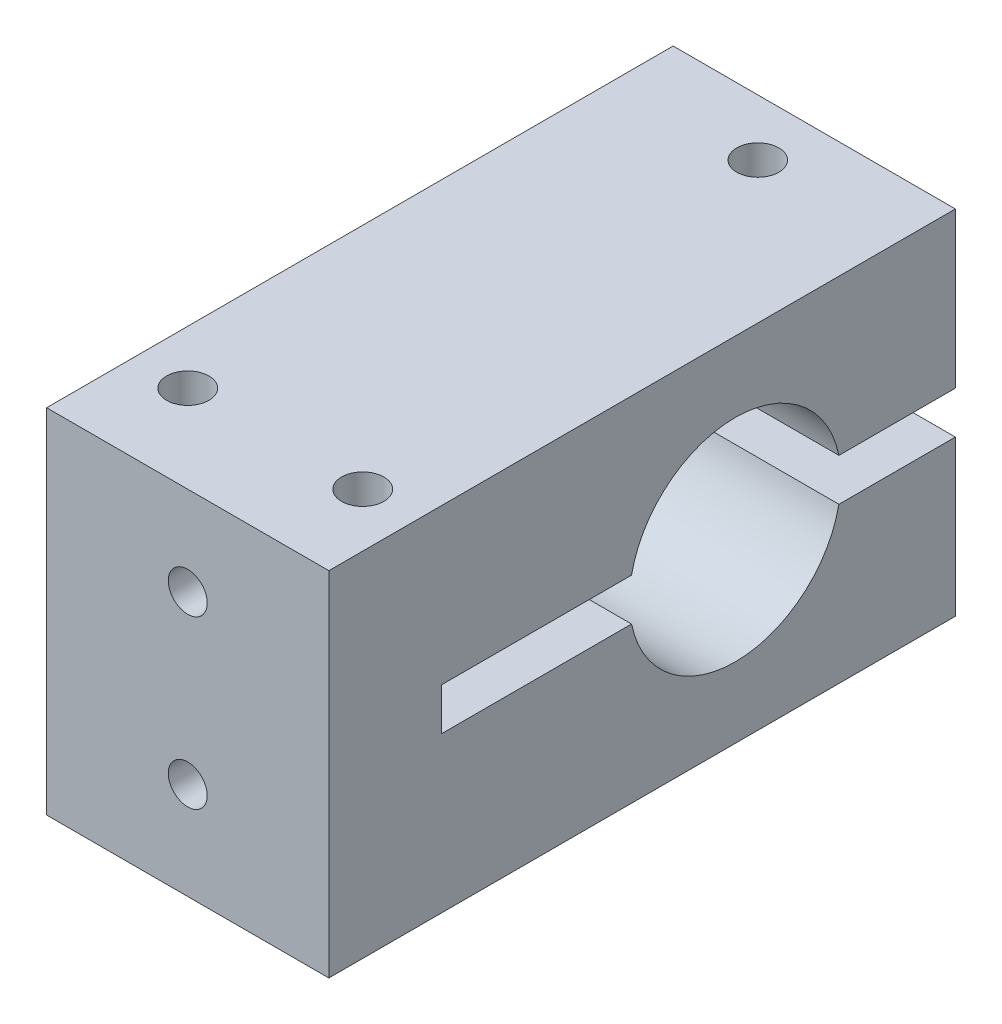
ISO-10303-21;
HEADER;
FILE_DESCRIPTION(('STEP AP214'),'2;1');
FILE_NAME('part.step','',(''),(''),'','','');
FILE_SCHEMA(('AUTOMOTIVE_DESIGN { 1 0 10303 214 1 1 1 1 }'));
ENDSEC;
DATA;
#1=APPLICATION_CONTEXT('core data for automotive mechanical design processes');
#2=APPLICATION_PROTOCOL_DEFINITION('international standard','automotive_design',2000,#1);
#3=PRODUCT_CONTEXT('',#1,'mechanical');
#4=PRODUCT('Part','Part','',(#3));
#5=PRODUCT_RELATED_PRODUCT_CATEGORY('part','',(#4));
#6=PRODUCT_DEFINITION_FORMATION('','',#4);
#7=PRODUCT_DEFINITION_CONTEXT('part definition',#1,'design');
#8=PRODUCT_DEFINITION('design','',#6,#7);
#9=PRODUCT_DEFINITION_SHAPE('','',#8);
#10=(LENGTH_UNIT() NAMED_UNIT(*) SI_UNIT(.MILLI.,.METRE.));
#11=(NAMED_UNIT(*) PLANE_ANGLE_UNIT() SI_UNIT($,.RADIAN.));
#12=(NAMED_UNIT(*) SI_UNIT($,.STERADIAN.) SOLID_ANGLE_UNIT());
#13=UNCERTAINTY_MEASURE_WITH_UNIT(LENGTH_MEASURE(1.E-05),#10,'distance_accuracy_value','');
#14=(GEOMETRIC_REPRESENTATION_CONTEXT(3) GLOBAL_UNCERTAINTY_ASSIGNED_CONTEXT((#13)) GLOBAL_UNIT_ASSIGNED_CONTEXT((#10,
#11,#12)) REPRESENTATION_CONTEXT('',''));
#15=CARTESIAN_POINT('',(0.,0.,0.));
#16=DIRECTION('',(0.,0.,1.));
#17=DIRECTION('',(1.,0.,0.));
#18=AXIS2_PLACEMENT_3D('',#15,#16,#17);
#19=CARTESIAN_POINT('',(-12.7,31.75,-28.194));
#20=DIRECTION('',(0.,1.,0.));
#21=DIRECTION('',(0.,0.,1.));
#22=AXIS2_PLACEMENT_3D('',#19,#20,#21);
#23=PLANE('',#22);
#24=DIRECTION('',(0.,0.,1.));
#25=VECTOR('',#24,1.);
#26=CARTESIAN_POINT('',(-12.7,31.75,-28.194));
#27=LINE('',#26,#25);
#28=CARTESIAN_POINT('',(-12.7,31.75,-28.194));
#29=VERTEX_POINT('',#28);
#30=CARTESIAN_POINT('',(-12.7,31.75,28.194));
#31=VERTEX_POINT('',#30);
#32=EDGE_CURVE('E220',#29,#31,#27,.T.);
#33=ORIENTED_EDGE('',*,*,#32,.T.);
#34=DIRECTION('',(1.,0.,0.));
#35=VECTOR('',#34,1.);
#36=CARTESIAN_POINT('',(-12.7,31.75,28.194));
#37=LINE('',#36,#35);
#38=CARTESIAN_POINT('',(12.7,31.75,28.194));
#39=VERTEX_POINT('',#38);
#40=EDGE_CURVE('E223',#31,#39,#37,.T.);
#41=ORIENTED_EDGE('',*,*,#40,.T.);
#42=DIRECTION('',(0.,0.,-1.));
#43=VECTOR('',#42,1.);
#44=CARTESIAN_POINT('',(12.7,31.75,-28.194));
#45=LINE('',#44,#43);
#46=CARTESIAN_POINT('',(12.7,31.75,-28.194));
#47=VERTEX_POINT('',#46);
#48=EDGE_CURVE('E225',#39,#47,#45,.T.);
#49=ORIENTED_EDGE('',*,*,#48,.T.);
#50=DIRECTION('',(-1.,0.,0.));
#51=VECTOR('',#50,1.);
#52=CARTESIAN_POINT('',(-12.7,31.75,-28.194));
#53=LINE('',#52,#51);
#54=EDGE_CURVE('E227',#47,#29,#53,.T.);
#55=ORIENTED_EDGE('',*,*,#54,.T.);
#56=EDGE_LOOP('',(#33,#41,#49,#55));
#57=FACE_BOUND('',#56,.T.);
#58=CARTESIAN_POINT('',(-7.874,31.75,20.32));
#59=DIRECTION('',(0.,1.,0.));
#60=DIRECTION('',(0.,0.,1.));
#61=AXIS2_PLACEMENT_3D('',#58,#59,#60);
#62=CIRCLE('',#61,1.905);
#63=CARTESIAN_POINT('',(-7.874,31.75,22.225));
#64=VERTEX_POINT('',#63);
#65=EDGE_CURVE('E166',#64,#64,#62,.T.);
#66=ORIENTED_EDGE('',*,*,#65,.F.);
#67=EDGE_LOOP('',(#66));
#68=FACE_BOUND('',#67,.T.);
#69=CARTESIAN_POINT('',(7.874,31.75,20.32));
#70=DIRECTION('',(0.,1.,0.));
#71=DIRECTION('',(0.,0.,1.));
#72=AXIS2_PLACEMENT_3D('',#69,#70,#71);
#73=CIRCLE('',#72,1.905);
#74=CARTESIAN_POINT('',(7.874,31.75,22.225));
#75=VERTEX_POINT('',#74);
#76=EDGE_CURVE('E160',#75,#75,#73,.T.);
#77=ORIENTED_EDGE('',*,*,#76,.F.);
#78=EDGE_LOOP('',(#77));
#79=FACE_BOUND('',#78,.T.);
#80=CARTESIAN_POINT('',(0.,31.75,-23.114));
#81=DIRECTION('',(0.,-1.,0.));
#82=DIRECTION('',(0.,0.,-1.));
#83=AXIS2_PLACEMENT_3D('',#80,#81,#82);
#84=CIRCLE('',#83,1.89864999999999);
#85=CARTESIAN_POINT('',(0.,31.75,-25.01265));
#86=VERTEX_POINT('',#85);
#87=EDGE_CURVE('E551',#86,#86,#84,.T.);
#88=ORIENTED_EDGE('',*,*,#87,.T.);
#89=EDGE_LOOP('',(#88));
#90=FACE_BOUND('',#89,.T.);
#91=ADVANCED_FACE('F30',(#57,#68,#79,#90),#23,.T.);
#92=CARTESIAN_POINT('',(-12.7,31.75,-28.194));
#93=DIRECTION('',(0.,0.,1.));
#94=DIRECTION('',(1.,0.,0.));
#95=AXIS2_PLACEMENT_3D('',#92,#93,#94);
#96=PLANE('',#95);
#97=DIRECTION('',(0.,-1.,0.));
#98=VECTOR('',#97,1.);
#99=CARTESIAN_POINT('',(-12.7,31.75,-28.194));
#100=LINE('',#99,#98);
#101=CARTESIAN_POINT('',(-12.7,13.97,-28.194));
#102=VERTEX_POINT('',#101);
#103=CARTESIAN_POINT('',(-12.7,0.,-28.194));
#104=VERTEX_POINT('',#103);
#105=EDGE_CURVE('E229',#102,#104,#100,.T.);
#106=ORIENTED_EDGE('',*,*,#105,.F.);
#107=DIRECTION('',(1.,0.,0.));
#108=VECTOR('',#107,1.);
#109=CARTESIAN_POINT('',(-12.7,13.97,-28.194));
#110=LINE('',#109,#108);
#111=CARTESIAN_POINT('',(12.7,13.97,-28.194));
#112=VERTEX_POINT('',#111);
#113=EDGE_CURVE('E198',#102,#112,#110,.T.);
#114=ORIENTED_EDGE('',*,*,#113,.T.);
#115=DIRECTION('',(0.,-1.,0.));
#116=VECTOR('',#115,1.);
#117=CARTESIAN_POINT('',(12.7,31.75,-28.194));
#118=LINE('',#117,#116);
#119=CARTESIAN_POINT('',(12.7,0.,-28.194));
#120=VERTEX_POINT('',#119);
#121=EDGE_CURVE('E233',#112,#120,#118,.T.);
#122=ORIENTED_EDGE('',*,*,#121,.T.);
#123=DIRECTION('',(-1.,0.,0.));
#124=VECTOR('',#123,1.);
#125=CARTESIAN_POINT('',(-12.7,0.,-28.194));
#126=LINE('',#125,#124);
#127=EDGE_CURVE('E217',#120,#104,#126,.T.);
#128=ORIENTED_EDGE('',*,*,#127,.T.);
#129=EDGE_LOOP('',(#106,#114,#122,#128));
#130=FACE_BOUND('',#129,.T.);
#131=ADVANCED_FACE('F266',(#130),#96,.F.);
#132=CARTESIAN_POINT('',(-12.7,15.875,-8.38199999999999));
#133=DIRECTION('',(1.,0.,0.));
#134=DIRECTION('',(0.,0.,-1.));
#135=AXIS2_PLACEMENT_3D('',#132,#133,#134);
#136=CYLINDRICAL_SURFACE('',#135,9.525);
#137=CARTESIAN_POINT('',(12.7,15.875,-8.382));
#138=DIRECTION('',(1.,0.,0.));
#139=DIRECTION('',(0.,0.,-1.));
#140=AXIS2_PLACEMENT_3D('',#137,#138,#139);
#141=CIRCLE('',#140,9.525);
#142=CARTESIAN_POINT('',(12.7,13.97,0.950555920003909));
#143=VERTEX_POINT('',#142);
#144=CARTESIAN_POINT('',(12.7,13.97,-17.7145559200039));
#145=VERTEX_POINT('',#144);
#146=EDGE_CURVE('E201',#143,#145,#141,.T.);
#147=ORIENTED_EDGE('',*,*,#146,.T.);
#148=DIRECTION('',(1.,0.,0.));
#149=VECTOR('',#148,1.);
#150=CARTESIAN_POINT('',(-12.7,13.97,-17.7145559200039));
#151=LINE('',#150,#149);
#152=CARTESIAN_POINT('',(-12.7,13.97,-17.7145559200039));
#153=VERTEX_POINT('',#152);
#154=EDGE_CURVE('E11',#145,#153,#151,.F.);
#155=ORIENTED_EDGE('',*,*,#154,.T.);
#156=CARTESIAN_POINT('',(-12.7,15.875,-8.38199999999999));
#157=DIRECTION('',(1.,0.,0.));
#158=DIRECTION('',(0.,0.,-1.));
#159=AXIS2_PLACEMENT_3D('',#156,#157,#158);
#160=CIRCLE('',#159,9.525);
#161=CARTESIAN_POINT('',(-12.7,13.97,0.950555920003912));
#162=VERTEX_POINT('',#161);
#163=EDGE_CURVE('E205',#162,#153,#160,.T.);
#164=ORIENTED_EDGE('',*,*,#163,.F.);
#165=DIRECTION('',(1.,0.,0.));
#166=VECTOR('',#165,1.);
#167=CARTESIAN_POINT('',(-12.7,13.97,0.950555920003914));
#168=LINE('',#167,#166);
#169=EDGE_CURVE('E39',#162,#143,#168,.T.);
#170=ORIENTED_EDGE('',*,*,#169,.T.);
#171=EDGE_LOOP('',(#147,#155,#164,#170));
#172=FACE_BOUND('',#171,.T.);
#173=ADVANCED_FACE('F253',(#172),#136,.F.);
#174=CARTESIAN_POINT('',(-12.7,31.75,-28.194));
#175=DIRECTION('',(1.,0.,0.));
#176=DIRECTION('',(0.,0.,-1.));
#177=AXIS2_PLACEMENT_3D('',#174,#175,#176);
#178=PLANE('',#177);
#179=ORIENTED_EDGE('',*,*,#163,.T.);
#180=DIRECTION('',(0.,0.,-1.));
#181=VECTOR('',#180,1.);
#182=CARTESIAN_POINT('',(-12.7,13.97,-32.766));
#183=LINE('',#182,#181);
#184=EDGE_CURVE('E54',#153,#102,#183,.T.);
#185=ORIENTED_EDGE('',*,*,#184,.T.);
#186=ORIENTED_EDGE('',*,*,#105,.T.);
#187=DIRECTION('',(0.,0.,1.));
#188=VECTOR('',#187,1.);
#189=CARTESIAN_POINT('',(-12.7,0.,-28.194));
#190=LINE('',#189,#188);
#191=CARTESIAN_POINT('',(-12.7,0.,28.194));
#192=VERTEX_POINT('',#191);
#193=EDGE_CURVE('E209',#104,#192,#190,.T.);
#194=ORIENTED_EDGE('',*,*,#193,.T.);
#195=DIRECTION('',(0.,-1.,0.));
#196=VECTOR('',#195,1.);
#197=CARTESIAN_POINT('',(-12.7,31.75,28.194));
#198=LINE('',#197,#196);
#199=EDGE_CURVE('E240',#31,#192,#198,.T.);
#200=ORIENTED_EDGE('',*,*,#199,.F.);
#201=ORIENTED_EDGE('',*,*,#32,.F.);
#202=CARTESIAN_POINT('',(-12.7,17.78,-28.194));
#203=VERTEX_POINT('',#202);
#204=EDGE_CURVE('E230',#29,#203,#100,.T.);
#205=ORIENTED_EDGE('',*,*,#204,.T.);
#206=DIRECTION('',(0.,0.,1.));
#207=VECTOR('',#206,1.);
#208=CARTESIAN_POINT('',(-12.7,17.78,-32.766));
#209=LINE('',#208,#207);
#210=CARTESIAN_POINT('',(-12.7,17.78,-17.7145559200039));
#211=VERTEX_POINT('',#210);
#212=EDGE_CURVE('E183',#203,#211,#209,.T.);
#213=ORIENTED_EDGE('',*,*,#212,.T.);
#214=CARTESIAN_POINT('',(-12.7,17.78,0.950555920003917));
#215=VERTEX_POINT('',#214);
#216=EDGE_CURVE('E206',#211,#215,#160,.T.);
#217=ORIENTED_EDGE('',*,*,#216,.T.);
#218=CARTESIAN_POINT('',(-12.7,17.78,18.034));
#219=VERTEX_POINT('',#218);
#220=EDGE_CURVE('E180',#215,#219,#209,.T.);
#221=ORIENTED_EDGE('',*,*,#220,.T.);
#222=DIRECTION('',(0.,-1.,0.));
#223=VECTOR('',#222,1.);
#224=CARTESIAN_POINT('',(-12.7,17.78,18.034));
#225=LINE('',#224,#223);
#226=CARTESIAN_POINT('',(-12.7,13.97,18.034));
#227=VERTEX_POINT('',#226);
#228=EDGE_CURVE('E184',#219,#227,#225,.T.);
#229=ORIENTED_EDGE('',*,*,#228,.T.);
#230=EDGE_CURVE('E187',#227,#162,#183,.T.);
#231=ORIENTED_EDGE('',*,*,#230,.T.);
#232=EDGE_LOOP('',(#179,#185,#186,#194,#200,#201,#205,#213,#217,#221,#229,#231));
#233=FACE_BOUND('',#232,.T.);
#234=ADVANCED_FACE('F32',(#233),#178,.F.);
#235=CARTESIAN_POINT('',(-12.7,31.75,28.194));
#236=DIRECTION('',(0.,0.,-1.));
#237=DIRECTION('',(-1.,0.,0.));
#238=AXIS2_PLACEMENT_3D('',#235,#236,#237);
#239=PLANE('',#238);
#240=CARTESIAN_POINT('',(0.,23.749,28.194));
#241=DIRECTION('',(0.,0.,1.));
#242=DIRECTION('',(1.,0.,0.));
#243=AXIS2_PLACEMENT_3D('',#240,#241,#242);
#244=CIRCLE('',#243,1.7526);
#245=CARTESIAN_POINT('',(1.75259999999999,23.749,28.194));
#246=VERTEX_POINT('',#245);
#247=EDGE_CURVE('E145',#246,#246,#244,.T.);
#248=ORIENTED_EDGE('',*,*,#247,.F.);
#249=EDGE_LOOP('',(#248));
#250=FACE_BOUND('',#249,.T.);
#251=CARTESIAN_POINT('',(0.,8.73533759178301,28.194));
#252=DIRECTION('',(0.,0.,1.));
#253=DIRECTION('',(1.,0.,0.));
#254=AXIS2_PLACEMENT_3D('',#251,#252,#253);
#255=CIRCLE('',#254,1.7526);
#256=CARTESIAN_POINT('',(1.7526,8.73533759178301,28.194));
#257=VERTEX_POINT('',#256);
#258=EDGE_CURVE('E157',#257,#257,#255,.T.);
#259=ORIENTED_EDGE('',*,*,#258,.F.);
#260=EDGE_LOOP('',(#259));
#261=FACE_BOUND('',#260,.T.);
#262=DIRECTION('',(1.,0.,0.));
#263=VECTOR('',#262,1.);
#264=CARTESIAN_POINT('',(-12.7,0.,28.194));
#265=LINE('',#264,#263);
#266=CARTESIAN_POINT('',(12.7,0.,28.194));
#267=VERTEX_POINT('',#266);
#268=EDGE_CURVE('E212',#192,#267,#265,.T.);
#269=ORIENTED_EDGE('',*,*,#268,.T.);
#270=DIRECTION('',(0.,-1.,0.));
#271=VECTOR('',#270,1.);
#272=CARTESIAN_POINT('',(12.7,31.75,28.194));
#273=LINE('',#272,#271);
#274=EDGE_CURVE('E237',#39,#267,#273,.T.);
#275=ORIENTED_EDGE('',*,*,#274,.F.);
#276=ORIENTED_EDGE('',*,*,#40,.F.);
#277=ORIENTED_EDGE('',*,*,#199,.T.);
#278=EDGE_LOOP('',(#269,#275,#276,#277));
#279=FACE_BOUND('',#278,.T.);
#280=ADVANCED_FACE('F295',(#250,#261,#279),#239,.F.);
#281=CARTESIAN_POINT('',(12.7,31.75,-28.194));
#282=DIRECTION('',(-1.,0.,0.));
#283=DIRECTION('',(0.,0.,1.));
#284=AXIS2_PLACEMENT_3D('',#281,#282,#283);
#285=PLANE('',#284);
#286=ORIENTED_EDGE('',*,*,#121,.F.);
#287=DIRECTION('',(0.,0.,-1.));
#288=VECTOR('',#287,1.);
#289=CARTESIAN_POINT('',(12.7,13.97,-32.766));
#290=LINE('',#289,#288);
#291=EDGE_CURVE('E177',#145,#112,#290,.T.);
#292=ORIENTED_EDGE('',*,*,#291,.F.);
#293=ORIENTED_EDGE('',*,*,#146,.F.);
#294=CARTESIAN_POINT('',(12.7,13.97,18.034));
#295=VERTEX_POINT('',#294);
#296=EDGE_CURVE('E178',#295,#143,#290,.T.);
#297=ORIENTED_EDGE('',*,*,#296,.F.);
#298=DIRECTION('',(0.,-1.,0.));
#299=VECTOR('',#298,1.);
#300=CARTESIAN_POINT('',(12.7,17.78,18.034));
#301=LINE('',#300,#299);
#302=CARTESIAN_POINT('',(12.7,17.78,18.034));
#303=VERTEX_POINT('',#302);
#304=EDGE_CURVE('E174',#303,#295,#301,.T.);
#305=ORIENTED_EDGE('',*,*,#304,.F.);
#306=DIRECTION('',(0.,0.,1.));
#307=VECTOR('',#306,1.);
#308=CARTESIAN_POINT('',(12.7,17.78,-32.766));
#309=LINE('',#308,#307);
#310=CARTESIAN_POINT('',(12.7,17.78,0.950555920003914));
#311=VERTEX_POINT('',#310);
#312=EDGE_CURVE('E172',#311,#303,#309,.T.);
#313=ORIENTED_EDGE('',*,*,#312,.F.);
#314=CARTESIAN_POINT('',(12.7,17.78,-17.7145559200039));
#315=VERTEX_POINT('',#314);
#316=EDGE_CURVE('E202',#315,#311,#141,.T.);
#317=ORIENTED_EDGE('',*,*,#316,.F.);
#318=CARTESIAN_POINT('',(12.7,17.78,-28.194));
#319=VERTEX_POINT('',#318);
#320=EDGE_CURVE('E46',#319,#315,#309,.T.);
#321=ORIENTED_EDGE('',*,*,#320,.F.);
#322=EDGE_CURVE('E234',#47,#319,#118,.T.);
#323=ORIENTED_EDGE('',*,*,#322,.F.);
#324=ORIENTED_EDGE('',*,*,#48,.F.);
#325=ORIENTED_EDGE('',*,*,#274,.T.);
#326=DIRECTION('',(0.,0.,-1.));
#327=VECTOR('',#326,1.);
#328=CARTESIAN_POINT('',(12.7,0.,-28.194));
#329=LINE('',#328,#327);
#330=EDGE_CURVE('E214',#267,#120,#329,.T.);
#331=ORIENTED_EDGE('',*,*,#330,.T.);
#332=EDGE_LOOP('',(#286,#292,#293,#297,#305,#313,#317,#321,#323,#324,#325,#331));
#333=FACE_BOUND('',#332,.T.);
#334=ADVANCED_FACE('F261',(#333),#285,.F.);
#335=ORIENTED_EDGE('',*,*,#322,.T.);
#336=DIRECTION('',(-1.,0.,0.));
#337=VECTOR('',#336,1.);
#338=CARTESIAN_POINT('',(-12.7,17.78,-28.194));
#339=LINE('',#338,#337);
#340=EDGE_CURVE('E193',#319,#203,#339,.T.);
#341=ORIENTED_EDGE('',*,*,#340,.T.);
#342=ORIENTED_EDGE('',*,*,#204,.F.);
#343=ORIENTED_EDGE('',*,*,#54,.F.);
#344=EDGE_LOOP('',(#335,#341,#342,#343));
#345=FACE_BOUND('',#344,.T.);
#346=ADVANCED_FACE('F287',(#345),#96,.F.);
#347=CARTESIAN_POINT('',(-12.7,0.,-28.194));
#348=DIRECTION('',(0.,1.,0.));
#349=DIRECTION('',(0.,0.,1.));
#350=AXIS2_PLACEMENT_3D('',#347,#348,#349);
#351=PLANE('',#350);
#352=CARTESIAN_POINT('',(0.,0.,-23.114));
#353=DIRECTION('',(0.,-1.,0.));
#354=DIRECTION('',(0.,0.,-1.));
#355=AXIS2_PLACEMENT_3D('',#352,#353,#354);
#356=CIRCLE('',#355,3.96875);
#357=CARTESIAN_POINT('',(0.,0.,-27.08275));
#358=VERTEX_POINT('',#357);
#359=EDGE_CURVE('E561',#358,#358,#356,.T.);
#360=ORIENTED_EDGE('',*,*,#359,.F.);
#361=EDGE_LOOP('',(#360));
#362=FACE_BOUND('',#361,.T.);
#363=CARTESIAN_POINT('',(7.874,0.,20.32));
#364=DIRECTION('',(0.,1.,0.));
#365=DIRECTION('',(0.,0.,1.));
#366=AXIS2_PLACEMENT_3D('',#363,#364,#365);
#367=CIRCLE('',#366,1.905);
#368=CARTESIAN_POINT('',(7.874,0.,22.225));
#369=VERTEX_POINT('',#368);
#370=EDGE_CURVE('E163',#369,#369,#367,.T.);
#371=ORIENTED_EDGE('',*,*,#370,.T.);
#372=EDGE_LOOP('',(#371));
#373=FACE_BOUND('',#372,.T.);
#374=CARTESIAN_POINT('',(-7.874,0.,20.32));
#375=DIRECTION('',(0.,1.,0.));
#376=DIRECTION('',(0.,0.,1.));
#377=AXIS2_PLACEMENT_3D('',#374,#375,#376);
#378=CIRCLE('',#377,1.905);
#379=CARTESIAN_POINT('',(-7.874,0.,22.225));
#380=VERTEX_POINT('',#379);
#381=EDGE_CURVE('E169',#380,#380,#378,.T.);
#382=ORIENTED_EDGE('',*,*,#381,.T.);
#383=EDGE_LOOP('',(#382));
#384=FACE_BOUND('',#383,.T.);
#385=ORIENTED_EDGE('',*,*,#193,.F.);
#386=ORIENTED_EDGE('',*,*,#127,.F.);
#387=ORIENTED_EDGE('',*,*,#330,.F.);
#388=ORIENTED_EDGE('',*,*,#268,.F.);
#389=EDGE_LOOP('',(#385,#386,#387,#388));
#390=FACE_BOUND('',#389,.T.);
#391=ADVANCED_FACE('F297',(#362,#373,#384,#390),#351,.F.);
#392=ORIENTED_EDGE('',*,*,#316,.T.);
#393=DIRECTION('',(1.,0.,0.));
#394=VECTOR('',#393,1.);
#395=CARTESIAN_POINT('',(-12.7,17.78,0.950555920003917));
#396=LINE('',#395,#394);
#397=EDGE_CURVE('E245',#311,#215,#396,.F.);
#398=ORIENTED_EDGE('',*,*,#397,.T.);
#399=ORIENTED_EDGE('',*,*,#216,.F.);
#400=DIRECTION('',(1.,0.,0.));
#401=VECTOR('',#400,1.);
#402=CARTESIAN_POINT('',(-12.7,17.78,-17.7145559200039));
#403=LINE('',#402,#401);
#404=EDGE_CURVE('E243',#211,#315,#403,.T.);
#405=ORIENTED_EDGE('',*,*,#404,.T.);
#406=EDGE_LOOP('',(#392,#398,#399,#405));
#407=FACE_BOUND('',#406,.T.);
#408=ADVANCED_FACE('F279',(#407),#136,.F.);
#409=CARTESIAN_POINT('',(-12.7,17.78,-32.766));
#410=DIRECTION('',(0.,1.,0.));
#411=DIRECTION('',(0.,0.,1.));
#412=AXIS2_PLACEMENT_3D('',#409,#410,#411);
#413=PLANE('',#412);
#414=CARTESIAN_POINT('',(0.,17.78,-23.114));
#415=DIRECTION('',(0.,1.,0.));
#416=DIRECTION('',(0.,0.,1.));
#417=AXIS2_PLACEMENT_3D('',#414,#415,#416);
#418=CIRCLE('',#417,1.89865);
#419=CARTESIAN_POINT('',(0.,17.78,-21.21535));
#420=VERTEX_POINT('',#419);
#421=EDGE_CURVE('E134',#420,#420,#418,.T.);
#422=ORIENTED_EDGE('',*,*,#421,.T.);
#423=EDGE_LOOP('',(#422));
#424=FACE_BOUND('',#423,.T.);
#425=ORIENTED_EDGE('',*,*,#320,.T.);
#426=ORIENTED_EDGE('',*,*,#404,.F.);
#427=ORIENTED_EDGE('',*,*,#212,.F.);
#428=ORIENTED_EDGE('',*,*,#340,.F.);
#429=EDGE_LOOP('',(#425,#426,#427,#428));
#430=FACE_BOUND('',#429,.T.);
#431=ADVANCED_FACE('F282',(#424,#430),#413,.F.);
#432=CARTESIAN_POINT('',(-12.7,13.97,-32.766));
#433=DIRECTION('',(0.,-1.,0.));
#434=DIRECTION('',(0.,0.,-1.));
#435=AXIS2_PLACEMENT_3D('',#432,#433,#434);
#436=PLANE('',#435);
#437=ORIENTED_EDGE('',*,*,#230,.F.);
#438=DIRECTION('',(1.,0.,0.));
#439=VECTOR('',#438,1.);
#440=CARTESIAN_POINT('',(-12.7,13.97,18.034));
#441=LINE('',#440,#439);
#442=EDGE_CURVE('E191',#227,#295,#441,.T.);
#443=ORIENTED_EDGE('',*,*,#442,.T.);
#444=ORIENTED_EDGE('',*,*,#296,.T.);
#445=ORIENTED_EDGE('',*,*,#169,.F.);
#446=EDGE_LOOP('',(#437,#443,#444,#445));
#447=FACE_BOUND('',#446,.T.);
#448=ADVANCED_FACE('F272',(#447),#436,.F.);
#449=ORIENTED_EDGE('',*,*,#312,.T.);
#450=DIRECTION('',(1.,0.,0.));
#451=VECTOR('',#450,1.);
#452=CARTESIAN_POINT('',(-12.7,17.78,18.034));
#453=LINE('',#452,#451);
#454=EDGE_CURVE('E190',#219,#303,#453,.T.);
#455=ORIENTED_EDGE('',*,*,#454,.F.);
#456=ORIENTED_EDGE('',*,*,#220,.F.);
#457=ORIENTED_EDGE('',*,*,#397,.F.);
#458=EDGE_LOOP('',(#449,#455,#456,#457));
#459=FACE_BOUND('',#458,.T.);
#460=ADVANCED_FACE('F352',(#459),#413,.F.);
#461=CARTESIAN_POINT('',(-12.7,17.78,18.034));
#462=DIRECTION('',(0.,0.,1.));
#463=DIRECTION('',(1.,0.,0.));
#464=AXIS2_PLACEMENT_3D('',#461,#462,#463);
#465=PLANE('',#464);
#466=ORIENTED_EDGE('',*,*,#304,.T.);
#467=ORIENTED_EDGE('',*,*,#442,.F.);
#468=ORIENTED_EDGE('',*,*,#228,.F.);
#469=ORIENTED_EDGE('',*,*,#454,.T.);
#470=EDGE_LOOP('',(#466,#467,#468,#469));
#471=FACE_BOUND('',#470,.T.);
#472=ADVANCED_FACE('F274',(#471),#465,.F.);
#473=CARTESIAN_POINT('',(0.,13.97,-23.114));
#474=DIRECTION('',(0.,-1.,0.));
#475=DIRECTION('',(0.,0.,-1.));
#476=AXIS2_PLACEMENT_3D('',#473,#474,#475);
#477=CIRCLE('',#476,1.89865);
#478=CARTESIAN_POINT('',(0.,13.97,-25.01265));
#479=VERTEX_POINT('',#478);
#480=EDGE_CURVE('E34',#479,#479,#477,.T.);
#481=ORIENTED_EDGE('',*,*,#480,.T.);
#482=EDGE_LOOP('',(#481));
#483=FACE_BOUND('',#482,.T.);
#484=ORIENTED_EDGE('',*,*,#184,.F.);
#485=ORIENTED_EDGE('',*,*,#154,.F.);
#486=ORIENTED_EDGE('',*,*,#291,.T.);
#487=ORIENTED_EDGE('',*,*,#113,.F.);
#488=EDGE_LOOP('',(#484,#485,#486,#487));
#489=FACE_BOUND('',#488,.T.);
#490=ADVANCED_FACE('F263',(#483,#489),#436,.F.);
#491=CARTESIAN_POINT('',(-7.874,0.,20.32));
#492=DIRECTION('',(0.,1.,0.));
#493=DIRECTION('',(0.,0.,1.));
#494=AXIS2_PLACEMENT_3D('',#491,#492,#493);
#495=CYLINDRICAL_SURFACE('',#494,1.905);
#496=ORIENTED_EDGE('',*,*,#381,.F.);
#497=EDGE_LOOP('',(#496));
#498=FACE_BOUND('',#497,.T.);
#499=ORIENTED_EDGE('',*,*,#65,.T.);
#500=EDGE_LOOP('',(#499));
#501=FACE_BOUND('',#500,.T.);
#502=ADVANCED_FACE('F338',(#498,#501),#495,.F.);
#503=CARTESIAN_POINT('',(7.874,0.,20.32));
#504=DIRECTION('',(0.,1.,0.));
#505=DIRECTION('',(0.,0.,1.));
#506=AXIS2_PLACEMENT_3D('',#503,#504,#505);
#507=CYLINDRICAL_SURFACE('',#506,1.905);
#508=ORIENTED_EDGE('',*,*,#370,.F.);
#509=EDGE_LOOP('',(#508));
#510=FACE_BOUND('',#509,.T.);
#511=ORIENTED_EDGE('',*,*,#76,.T.);
#512=EDGE_LOOP('',(#511));
#513=FACE_BOUND('',#512,.T.);
#514=ADVANCED_FACE('F328',(#510,#513),#507,.F.);
#515=CARTESIAN_POINT('',(0.,8.73533759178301,28.194));
#516=DIRECTION('',(0.,0.,1.));
#517=DIRECTION('',(1.,0.,0.));
#518=AXIS2_PLACEMENT_3D('',#515,#516,#517);
#519=CYLINDRICAL_SURFACE('',#518,1.7526);
#520=CARTESIAN_POINT('',(0.,8.73533759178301,15.494));
#521=DIRECTION('',(0.,0.,1.));
#522=DIRECTION('',(1.,0.,0.));
#523=AXIS2_PLACEMENT_3D('',#520,#521,#522);
#524=CIRCLE('',#523,1.7526);
#525=CARTESIAN_POINT('',(1.75259999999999,8.73533759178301,15.494));
#526=VERTEX_POINT('',#525);
#527=EDGE_CURVE('E154',#526,#526,#524,.T.);
#528=ORIENTED_EDGE('',*,*,#527,.F.);
#529=EDGE_LOOP('',(#528));
#530=FACE_BOUND('',#529,.T.);
#531=ORIENTED_EDGE('',*,*,#258,.T.);
#532=EDGE_LOOP('',(#531));
#533=FACE_BOUND('',#532,.T.);
#534=ADVANCED_FACE('F325',(#530,#533),#519,.F.);
#535=CARTESIAN_POINT('',(1.35254999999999,8.73533759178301,15.494));
#536=DIRECTION('',(0.,0.,-1.));
#537=DIRECTION('',(-1.,0.,0.));
#538=AXIS2_PLACEMENT_3D('',#535,#536,#537);
#539=PLANE('',#538);
#540=CARTESIAN_POINT('',(0.,8.73533759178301,15.494));
#541=DIRECTION('',(0.,0.,1.));
#542=DIRECTION('',(1.,0.,0.));
#543=AXIS2_PLACEMENT_3D('',#540,#541,#542);
#544=CIRCLE('',#543,1.35255);
#545=CARTESIAN_POINT('',(1.35254999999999,8.73533759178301,15.494));
#546=VERTEX_POINT('',#545);
#547=EDGE_CURVE('E151',#546,#546,#544,.T.);
#548=ORIENTED_EDGE('',*,*,#547,.F.);
#549=EDGE_LOOP('',(#548));
#550=FACE_BOUND('',#549,.T.);
#551=ORIENTED_EDGE('',*,*,#527,.T.);
#552=EDGE_LOOP('',(#551));
#553=FACE_BOUND('',#552,.T.);
#554=ADVANCED_FACE('F327',(#550,#553),#539,.F.);
#555=CARTESIAN_POINT('',(0.,8.73533759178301,28.194));
#556=DIRECTION('',(0.,0.,1.));
#557=DIRECTION('',(1.,0.,0.));
#558=AXIS2_PLACEMENT_3D('',#555,#556,#557);
#559=CYLINDRICAL_SURFACE('',#558,1.35255);
#560=CARTESIAN_POINT('',(0.,8.73533759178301,11.43));
#561=DIRECTION('',(0.,0.,1.));
#562=DIRECTION('',(1.,0.,0.));
#563=AXIS2_PLACEMENT_3D('',#560,#561,#562);
#564=CIRCLE('',#563,1.35255);
#565=CARTESIAN_POINT('',(1.35254999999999,8.73533759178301,11.43));
#566=VERTEX_POINT('',#565);
#567=EDGE_CURVE('E148',#566,#566,#564,.T.);
#568=ORIENTED_EDGE('',*,*,#567,.F.);
#569=EDGE_LOOP('',(#568));
#570=FACE_BOUND('',#569,.T.);
#571=ORIENTED_EDGE('',*,*,#547,.T.);
#572=EDGE_LOOP('',(#571));
#573=FACE_BOUND('',#572,.T.);
#574=ADVANCED_FACE('F335',(#570,#573),#559,.F.);
#575=CARTESIAN_POINT('',(0.,8.73533759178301,11.43));
#576=DIRECTION('',(0.,0.,1.));
#577=DIRECTION('',(1.,0.,0.));
#578=AXIS2_PLACEMENT_3D('',#575,#576,#577);
#579=CONICAL_SURFACE('',#578,1.35255,1.02974425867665);
#580=CARTESIAN_POINT('',(0.,8.73533759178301,10.6173059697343));
#581=VERTEX_POINT('',#580);
#582=VERTEX_LOOP('',#581);
#583=FACE_BOUND('',#582,.T.);
#584=ORIENTED_EDGE('',*,*,#567,.T.);
#585=EDGE_LOOP('',(#584));
#586=FACE_BOUND('',#585,.T.);
#587=ADVANCED_FACE('F405',(#583,#586),#579,.F.);
#588=CARTESIAN_POINT('',(0.,23.749,28.194));
#589=DIRECTION('',(0.,0.,1.));
#590=DIRECTION('',(1.,0.,0.));
#591=AXIS2_PLACEMENT_3D('',#588,#589,#590);
#592=CYLINDRICAL_SURFACE('',#591,1.7526);
#593=CARTESIAN_POINT('',(0.,23.749,15.494));
#594=DIRECTION('',(0.,0.,1.));
#595=DIRECTION('',(1.,0.,0.));
#596=AXIS2_PLACEMENT_3D('',#593,#594,#595);
#597=CIRCLE('',#596,1.7526);
#598=CARTESIAN_POINT('',(1.75259999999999,23.749,15.494));
#599=VERTEX_POINT('',#598);
#600=EDGE_CURVE('E137',#599,#599,#597,.T.);
#601=ORIENTED_EDGE('',*,*,#600,.F.);
#602=EDGE_LOOP('',(#601));
#603=FACE_BOUND('',#602,.T.);
#604=ORIENTED_EDGE('',*,*,#247,.T.);
#605=EDGE_LOOP('',(#604));
#606=FACE_BOUND('',#605,.T.);
#607=ADVANCED_FACE('F414',(#603,#606),#592,.F.);
#608=CARTESIAN_POINT('',(1.35254999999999,23.749,15.494));
#609=DIRECTION('',(0.,0.,-1.));
#610=DIRECTION('',(-1.,0.,0.));
#611=AXIS2_PLACEMENT_3D('',#608,#609,#610);
#612=PLANE('',#611);
#613=CARTESIAN_POINT('',(0.,23.749,15.494));
#614=DIRECTION('',(0.,0.,1.));
#615=DIRECTION('',(1.,0.,0.));
#616=AXIS2_PLACEMENT_3D('',#613,#614,#615);
#617=CIRCLE('',#616,1.35255);
#618=CARTESIAN_POINT('',(1.35254999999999,23.749,15.494));
#619=VERTEX_POINT('',#618);
#620=EDGE_CURVE('E133',#619,#619,#617,.T.);
#621=ORIENTED_EDGE('',*,*,#620,.F.);
#622=EDGE_LOOP('',(#621));
#623=FACE_BOUND('',#622,.T.);
#624=ORIENTED_EDGE('',*,*,#600,.T.);
#625=EDGE_LOOP('',(#624));
#626=FACE_BOUND('',#625,.T.);
#627=ADVANCED_FACE('F424',(#623,#626),#612,.F.);
#628=CARTESIAN_POINT('',(0.,23.749,28.194));
#629=DIRECTION('',(0.,0.,1.));
#630=DIRECTION('',(1.,0.,0.));
#631=AXIS2_PLACEMENT_3D('',#628,#629,#630);
#632=CYLINDRICAL_SURFACE('',#631,1.35255);
#633=CARTESIAN_POINT('',(0.,23.749,11.43));
#634=DIRECTION('',(0.,0.,1.));
#635=DIRECTION('',(1.,0.,0.));
#636=AXIS2_PLACEMENT_3D('',#633,#634,#635);
#637=CIRCLE('',#636,1.35255);
#638=CARTESIAN_POINT('',(1.35254999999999,23.749,11.43));
#639=VERTEX_POINT('',#638);
#640=EDGE_CURVE('E131',#639,#639,#637,.T.);
#641=ORIENTED_EDGE('',*,*,#640,.F.);
#642=EDGE_LOOP('',(#641));
#643=FACE_BOUND('',#642,.T.);
#644=ORIENTED_EDGE('',*,*,#620,.T.);
#645=EDGE_LOOP('',(#644));
#646=FACE_BOUND('',#645,.T.);
#647=ADVANCED_FACE('F127',(#643,#646),#632,.F.);
#648=CARTESIAN_POINT('',(0.,23.749,11.43));
#649=DIRECTION('',(0.,0.,1.));
#650=DIRECTION('',(1.,0.,0.));
#651=AXIS2_PLACEMENT_3D('',#648,#649,#650);
#652=CONICAL_SURFACE('',#651,1.35255,1.02974425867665);
#653=CARTESIAN_POINT('',(0.,23.749,10.6173059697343));
#654=VERTEX_POINT('',#653);
#655=VERTEX_LOOP('',#654);
#656=FACE_BOUND('',#655,.T.);
#657=ORIENTED_EDGE('',*,*,#640,.T.);
#658=EDGE_LOOP('',(#657));
#659=FACE_BOUND('',#658,.T.);
#660=ADVANCED_FACE('F123',(#656,#659),#652,.F.);
#661=CARTESIAN_POINT('',(1.89865,2.2098,-23.114));
#662=DIRECTION('',(0.,1.,0.));
#663=DIRECTION('',(0.,0.,1.));
#664=AXIS2_PLACEMENT_3D('',#661,#662,#663);
#665=PLANE('',#664);
#666=CARTESIAN_POINT('',(0.,2.2098,-23.114));
#667=DIRECTION('',(0.,-1.,0.));
#668=DIRECTION('',(0.,0.,-1.));
#669=AXIS2_PLACEMENT_3D('',#666,#667,#668);
#670=CIRCLE('',#669,1.89865);
#671=CARTESIAN_POINT('',(0.,2.2098,-25.01265));
#672=VERTEX_POINT('',#671);
#673=EDGE_CURVE('E554',#672,#672,#670,.T.);
#674=ORIENTED_EDGE('',*,*,#673,.F.);
#675=EDGE_LOOP('',(#674));
#676=FACE_BOUND('',#675,.T.);
#677=CARTESIAN_POINT('',(0.,2.2098,-23.114));
#678=DIRECTION('',(0.,-1.,0.));
#679=DIRECTION('',(0.,0.,-1.));
#680=AXIS2_PLACEMENT_3D('',#677,#678,#679);
#681=CIRCLE('',#680,3.96875);
#682=CARTESIAN_POINT('',(0.,2.2098,-27.08275));
#683=VERTEX_POINT('',#682);
#684=EDGE_CURVE('E557',#683,#683,#681,.T.);
#685=ORIENTED_EDGE('',*,*,#684,.T.);
#686=EDGE_LOOP('',(#685));
#687=FACE_BOUND('',#686,.T.);
#688=ADVANCED_FACE('F126',(#676,#687),#665,.F.);
#689=CARTESIAN_POINT('',(0.,0.,-23.114));
#690=DIRECTION('',(0.,-1.,0.));
#691=DIRECTION('',(0.,0.,-1.));
#692=AXIS2_PLACEMENT_3D('',#689,#690,#691);
#693=CYLINDRICAL_SURFACE('',#692,3.96875);
#694=ORIENTED_EDGE('',*,*,#684,.F.);
#695=EDGE_LOOP('',(#694));
#696=FACE_BOUND('',#695,.T.);
#697=ORIENTED_EDGE('',*,*,#359,.T.);
#698=EDGE_LOOP('',(#697));
#699=FACE_BOUND('',#698,.T.);
#700=ADVANCED_FACE('F516',(#696,#699),#693,.F.);
#701=CARTESIAN_POINT('',(0.,0.,-23.114));
#702=DIRECTION('',(0.,-1.,0.));
#703=DIRECTION('',(0.,0.,-1.));
#704=AXIS2_PLACEMENT_3D('',#701,#702,#703);
#705=CYLINDRICAL_SURFACE('',#704,1.89865);
#706=ORIENTED_EDGE('',*,*,#673,.T.);
#707=EDGE_LOOP('',(#706));
#708=FACE_BOUND('',#707,.T.);
#709=ORIENTED_EDGE('',*,*,#480,.F.);
#710=EDGE_LOOP('',(#709));
#711=FACE_BOUND('',#710,.T.);
#712=ADVANCED_FACE('F525',(#708,#711),#705,.F.);
#713=ORIENTED_EDGE('',*,*,#87,.F.);
#714=EDGE_LOOP('',(#713));
#715=FACE_BOUND('',#714,.T.);
#716=ORIENTED_EDGE('',*,*,#421,.F.);
#717=EDGE_LOOP('',(#716));
#718=FACE_BOUND('',#717,.T.);
#719=ADVANCED_FACE('F534',(#715,#718),#705,.F.);
#720=CLOSED_SHELL('',(#91,#131,#173,#234,#280,#334,#346,#391,#408,#431,#448,#460,#472,#490,#502,
#514,#534,#554,#574,#587,#607,#627,#647,#660,#688,#700,#712,#719));
#721=MANIFOLD_SOLID_BREP('B2',#720);
#722=ADVANCED_BREP_SHAPE_REPRESENTATION('',(#18,#721),#14);
#723=SHAPE_DEFINITION_REPRESENTATION(#9,#722);
ENDSEC;
END-ISO-10303-21;
